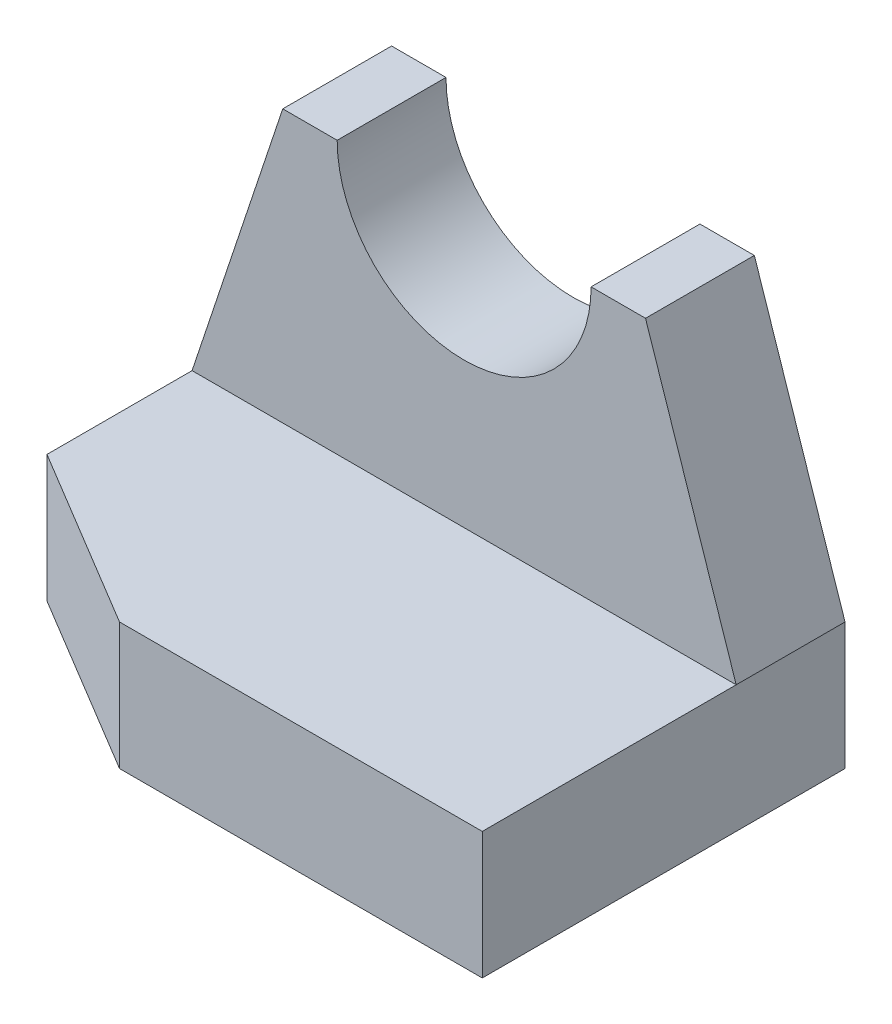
from build123d import *

# Parameters (mm, degrees)
EXTRUDE_1_DEPTH = 7
EXTRUDE_2_DEPTH = 6


with BuildPart() as part:
    # Sketch 1 → Extrude 1 (new body)
    with BuildSketch(Plane(origin=(0, 0, 0), x_dir=(1, 0, 0), z_dir=(0, 1, 0))):
        Polygon((-15, 0), (15, 0), (15, -20), (-5, -20), (-15, -14), align=None)
    extrude(amount=EXTRUDE_1_DEPTH)

    # Sketch 2 → Extrude 2 (add)
    with BuildSketch(Plane(origin=(0, 0, 0), x_dir=(-1, 0, 0), z_dir=(0, 0, -1))):
        with BuildLine():
            Line((-10, 22), (-7, 22))
            ThreePointArc((-7, 22), (0, 15), (7, 22))
            Line((7, 22), (10, 22))
            Line((10, 22), (15, 7))
            Line((15, 7), (-15, 7))
            Line((-15, 7), (-10, 22))
        make_face()
    extrude(amount=-EXTRUDE_2_DEPTH)


solid = part.part
